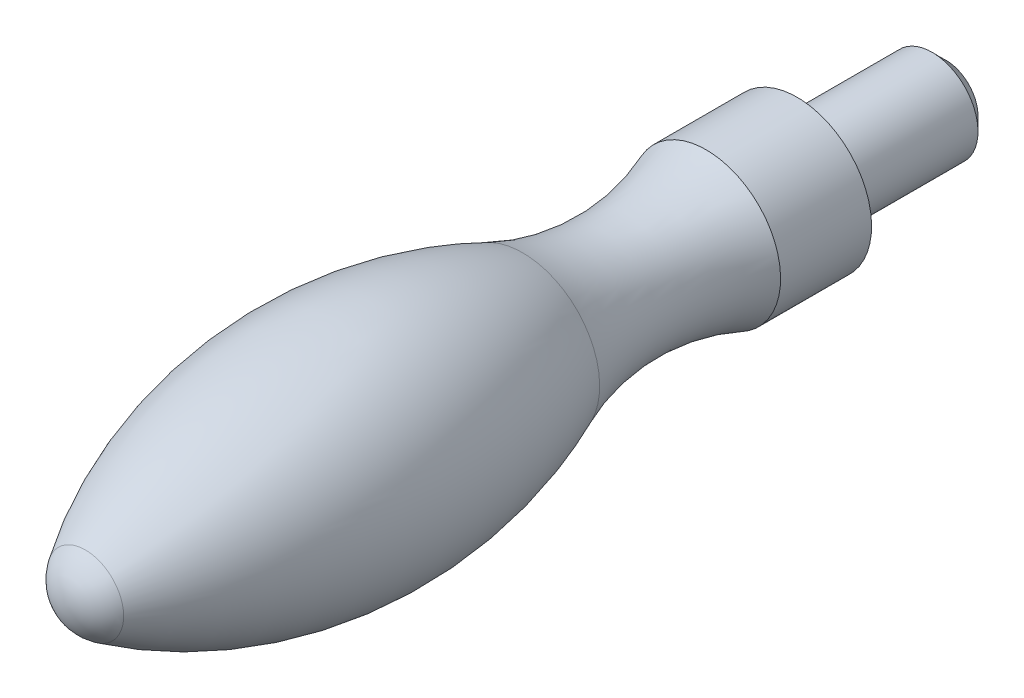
ISO-10303-21;
HEADER;
FILE_DESCRIPTION(('STEP AP214'),'2;1');
FILE_NAME('part.step','',(''),(''),'','','');
FILE_SCHEMA(('AUTOMOTIVE_DESIGN { 1 0 10303 214 1 1 1 1 }'));
ENDSEC;
DATA;
#1=APPLICATION_CONTEXT('core data for automotive mechanical design processes');
#2=APPLICATION_PROTOCOL_DEFINITION('international standard','automotive_design',2000,#1);
#3=PRODUCT_CONTEXT('',#1,'mechanical');
#4=PRODUCT('Part','Part','',(#3));
#5=PRODUCT_RELATED_PRODUCT_CATEGORY('part','',(#4));
#6=PRODUCT_DEFINITION_FORMATION('','',#4);
#7=PRODUCT_DEFINITION_CONTEXT('part definition',#1,'design');
#8=PRODUCT_DEFINITION('design','',#6,#7);
#9=PRODUCT_DEFINITION_SHAPE('','',#8);
#10=(LENGTH_UNIT() NAMED_UNIT(*) SI_UNIT(.MILLI.,.METRE.));
#11=(NAMED_UNIT(*) PLANE_ANGLE_UNIT() SI_UNIT($,.RADIAN.));
#12=(NAMED_UNIT(*) SI_UNIT($,.STERADIAN.) SOLID_ANGLE_UNIT());
#13=UNCERTAINTY_MEASURE_WITH_UNIT(LENGTH_MEASURE(1.E-05),#10,'distance_accuracy_value','');
#14=(GEOMETRIC_REPRESENTATION_CONTEXT(3) GLOBAL_UNCERTAINTY_ASSIGNED_CONTEXT((#13)) GLOBAL_UNIT_ASSIGNED_CONTEXT((#10,
#11,#12)) REPRESENTATION_CONTEXT('',''));
#15=CARTESIAN_POINT('',(0.,0.,0.));
#16=DIRECTION('',(0.,0.,1.));
#17=DIRECTION('',(1.,0.,0.));
#18=AXIS2_PLACEMENT_3D('',#15,#16,#17);
#19=CARTESIAN_POINT('',(-1.02446461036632E-06,0.,59.999939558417));
#20=DIRECTION('',(0.,0.,1.));
#21=DIRECTION('',(1.,0.,0.));
#22=AXIS2_PLACEMENT_3D('',#19,#20,#21);
#23=SPHERICAL_SURFACE('',#22,3.99999884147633);
#24=CARTESIAN_POINT('',(0.,0.,62.197192));
#25=DIRECTION('',(0.,0.,1.));
#26=DIRECTION('',(0.,-1.,0.));
#27=AXIS2_PLACEMENT_3D('',#24,#25,#26);
#28=CIRCLE('',#27,3.342464);
#29=CARTESIAN_POINT('',(0.,-3.342464,62.197192));
#30=VERTEX_POINT('',#29);
#31=EDGE_CURVE('E133',#30,#30,#28,.T.);
#32=ORIENTED_EDGE('',*,*,#31,.T.);
#33=EDGE_LOOP('',(#32));
#34=FACE_BOUND('',#33,.T.);
#35=ADVANCED_FACE('F14',(#34),#23,.T.);
#36=CARTESIAN_POINT('',(0.,0.,39.95));
#37=DIRECTION('',(0.,0.,1.));
#38=DIRECTION('',(0.,-1.,0.));
#39=AXIS2_PLACEMENT_3D('',#36,#37,#38);
#40=DEGENERATE_TOROIDAL_SURFACE('',#39,30.5,40.4999990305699,.F.);
#41=CARTESIAN_POINT('',(0.,0.,23.9808672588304));
#42=DIRECTION('',(0.,0.,1.));
#43=DIRECTION('',(0.,-1.,0.));
#44=AXIS2_PLACEMENT_3D('',#41,#42,#43);
#45=CIRCLE('',#44,6.71876839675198);
#46=CARTESIAN_POINT('',(0.,-6.71876839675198,23.9808672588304));
#47=VERTEX_POINT('',#46);
#48=EDGE_CURVE('E130',#47,#47,#45,.T.);
#49=ORIENTED_EDGE('',*,*,#48,.T.);
#50=EDGE_LOOP('',(#49));
#51=FACE_BOUND('',#50,.T.);
#52=ORIENTED_EDGE('',*,*,#31,.F.);
#53=EDGE_LOOP('',(#52));
#54=FACE_BOUND('',#53,.T.);
#55=ADVANCED_FACE('F151',(#51,#54),#40,.F.);
#56=CARTESIAN_POINT('',(0.,0.,15.7005784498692));
#57=DIRECTION('',(0.,0.,1.));
#58=DIRECTION('',(0.,-1.,0.));
#59=AXIS2_PLACEMENT_3D('',#56,#57,#58);
#60=TOROIDAL_SURFACE('',#59,26.017389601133,20.9999991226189);
#61=CARTESIAN_POINT('',(0.,0.,7.95));
#62=DIRECTION('',(0.,0.,1.));
#63=DIRECTION('',(0.,-1.,0.));
#64=AXIS2_PLACEMENT_3D('',#61,#62,#63);
#65=CIRCLE('',#64,6.5);
#66=CARTESIAN_POINT('',(0.,-6.5,7.95));
#67=VERTEX_POINT('',#66);
#68=EDGE_CURVE('E127',#67,#67,#65,.T.);
#69=ORIENTED_EDGE('',*,*,#68,.T.);
#70=EDGE_LOOP('',(#69));
#71=FACE_BOUND('',#70,.T.);
#72=ORIENTED_EDGE('',*,*,#48,.F.);
#73=EDGE_LOOP('',(#72));
#74=FACE_BOUND('',#73,.T.);
#75=ADVANCED_FACE('F156',(#71,#74),#60,.F.);
#76=CARTESIAN_POINT('',(0.,0.,67.0499368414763));
#77=DIRECTION('',(0.,0.,1.));
#78=DIRECTION('',(0.,-1.,0.));
#79=AXIS2_PLACEMENT_3D('',#76,#77,#78);
#80=CYLINDRICAL_SURFACE('',#79,6.5);
#81=CARTESIAN_POINT('',(0.,0.,0.));
#82=DIRECTION('',(0.,0.,1.));
#83=DIRECTION('',(0.,-1.,0.));
#84=AXIS2_PLACEMENT_3D('',#81,#82,#83);
#85=CIRCLE('',#84,6.5);
#86=CARTESIAN_POINT('',(0.,-6.5,0.));
#87=VERTEX_POINT('',#86);
#88=EDGE_CURVE('E124',#87,#87,#85,.T.);
#89=ORIENTED_EDGE('',*,*,#88,.T.);
#90=EDGE_LOOP('',(#89));
#91=FACE_BOUND('',#90,.T.);
#92=ORIENTED_EDGE('',*,*,#68,.F.);
#93=EDGE_LOOP('',(#92));
#94=FACE_BOUND('',#93,.T.);
#95=ADVANCED_FACE('F162',(#91,#94),#80,.T.);
#96=CARTESIAN_POINT('',(6.5,0.,0.));
#97=DIRECTION('',(0.,0.,-1.));
#98=DIRECTION('',(0.,1.,0.));
#99=AXIS2_PLACEMENT_3D('',#96,#97,#98);
#100=PLANE('',#99);
#101=CARTESIAN_POINT('',(0.,0.,0.));
#102=DIRECTION('',(0.,0.,1.));
#103=DIRECTION('',(0.,-1.,0.));
#104=AXIS2_PLACEMENT_3D('',#101,#102,#103);
#105=CIRCLE('',#104,4.);
#106=CARTESIAN_POINT('',(0.,-4.,0.));
#107=VERTEX_POINT('',#106);
#108=EDGE_CURVE('E116',#107,#107,#105,.T.);
#109=ORIENTED_EDGE('',*,*,#108,.T.);
#110=EDGE_LOOP('',(#109));
#111=FACE_BOUND('',#110,.T.);
#112=ORIENTED_EDGE('',*,*,#88,.F.);
#113=EDGE_LOOP('',(#112));
#114=FACE_BOUND('',#113,.T.);
#115=ADVANCED_FACE('F166',(#111,#114),#100,.T.);
#116=CARTESIAN_POINT('',(0.,0.,67.0499368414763));
#117=DIRECTION('',(0.,0.,1.));
#118=DIRECTION('',(0.,-1.,0.));
#119=AXIS2_PLACEMENT_3D('',#116,#117,#118);
#120=CYLINDRICAL_SURFACE('',#119,4.);
#121=CARTESIAN_POINT('',(0.,0.,-11.8));
#122=DIRECTION('',(0.,0.,-1.));
#123=DIRECTION('',(-1.,0.,0.));
#124=AXIS2_PLACEMENT_3D('',#121,#122,#123);
#125=CIRCLE('',#124,4.);
#126=CARTESIAN_POINT('',(-4.,0.,-11.8));
#127=VERTEX_POINT('',#126);
#128=EDGE_CURVE('E22',#127,#127,#125,.F.);
#129=ORIENTED_EDGE('',*,*,#128,.T.);
#130=EDGE_LOOP('',(#129));
#131=FACE_BOUND('',#130,.T.);
#132=ORIENTED_EDGE('',*,*,#108,.F.);
#133=EDGE_LOOP('',(#132));
#134=FACE_BOUND('',#133,.T.);
#135=ADVANCED_FACE('F138',(#131,#134),#120,.T.);
#136=CARTESIAN_POINT('',(4.,0.,-13.));
#137=DIRECTION('',(0.,0.,-1.));
#138=DIRECTION('',(0.,1.,0.));
#139=AXIS2_PLACEMENT_3D('',#136,#137,#138);
#140=PLANE('',#139);
#141=CARTESIAN_POINT('',(0.,0.,-13.));
#142=DIRECTION('',(0.,0.,-1.));
#143=DIRECTION('',(-1.,0.,0.));
#144=AXIS2_PLACEMENT_3D('',#141,#142,#143);
#145=CIRCLE('',#144,2.8);
#146=CARTESIAN_POINT('',(-2.8,0.,-13.));
#147=VERTEX_POINT('',#146);
#148=EDGE_CURVE('E9',#147,#147,#145,.T.);
#149=ORIENTED_EDGE('',*,*,#148,.T.);
#150=EDGE_LOOP('',(#149));
#151=FACE_BOUND('',#150,.T.);
#152=DIRECTION('',(0.866025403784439,0.5,0.));
#153=VECTOR('',#152,1.);
#154=CARTESIAN_POINT('',(-2.,1.15470053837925,-13.));
#155=LINE('',#154,#153);
#156=CARTESIAN_POINT('',(-2.,1.15470053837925,-13.));
#157=VERTEX_POINT('',#156);
#158=CARTESIAN_POINT('',(0.,2.30940107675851,-13.));
#159=VERTEX_POINT('',#158);
#160=EDGE_CURVE('E29',#157,#159,#155,.T.);
#161=ORIENTED_EDGE('',*,*,#160,.F.);
#162=DIRECTION('',(0.,1.,0.));
#163=VECTOR('',#162,1.);
#164=CARTESIAN_POINT('',(-2.,-1.15470053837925,-13.));
#165=LINE('',#164,#163);
#166=CARTESIAN_POINT('',(-2.,-1.15470053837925,-13.));
#167=VERTEX_POINT('',#166);
#168=EDGE_CURVE('E112',#167,#157,#165,.T.);
#169=ORIENTED_EDGE('',*,*,#168,.F.);
#170=DIRECTION('',(-0.866025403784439,0.5,0.));
#171=VECTOR('',#170,1.);
#172=CARTESIAN_POINT('',(0.,-2.30940107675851,-13.));
#173=LINE('',#172,#171);
#174=CARTESIAN_POINT('',(0.,-2.30940107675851,-13.));
#175=VERTEX_POINT('',#174);
#176=EDGE_CURVE('E110',#175,#167,#173,.T.);
#177=ORIENTED_EDGE('',*,*,#176,.F.);
#178=DIRECTION('',(-0.866025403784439,-0.5,0.));
#179=VECTOR('',#178,1.);
#180=CARTESIAN_POINT('',(2.,-1.15470053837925,-13.));
#181=LINE('',#180,#179);
#182=CARTESIAN_POINT('',(2.,-1.15470053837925,-13.));
#183=VERTEX_POINT('',#182);
#184=EDGE_CURVE('E77',#183,#175,#181,.T.);
#185=ORIENTED_EDGE('',*,*,#184,.F.);
#186=DIRECTION('',(0.,-1.,0.));
#187=VECTOR('',#186,1.);
#188=CARTESIAN_POINT('',(2.,1.15470053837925,-13.));
#189=LINE('',#188,#187);
#190=CARTESIAN_POINT('',(2.,1.15470053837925,-13.));
#191=VERTEX_POINT('',#190);
#192=EDGE_CURVE('E106',#191,#183,#189,.T.);
#193=ORIENTED_EDGE('',*,*,#192,.F.);
#194=DIRECTION('',(0.866025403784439,-0.5,0.));
#195=VECTOR('',#194,1.);
#196=CARTESIAN_POINT('',(0.,2.30940107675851,-13.));
#197=LINE('',#196,#195);
#198=EDGE_CURVE('E103',#159,#191,#197,.T.);
#199=ORIENTED_EDGE('',*,*,#198,.F.);
#200=EDGE_LOOP('',(#161,#169,#177,#185,#193,#199));
#201=FACE_BOUND('',#200,.T.);
#202=ADVANCED_FACE('F173',(#151,#201),#140,.T.);
#203=CARTESIAN_POINT('',(-2.,1.15470053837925,-9.));
#204=DIRECTION('',(-0.5,0.866025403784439,0.));
#205=DIRECTION('',(-0.866025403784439,-0.5,0.));
#206=AXIS2_PLACEMENT_3D('',#203,#204,#205);
#207=PLANE('',#206);
#208=ORIENTED_EDGE('',*,*,#160,.T.);
#209=DIRECTION('',(0.,0.,-1.));
#210=VECTOR('',#209,1.);
#211=CARTESIAN_POINT('',(0.,2.30940107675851,-9.));
#212=LINE('',#211,#210);
#213=CARTESIAN_POINT('',(0.,2.30940107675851,-9.));
#214=VERTEX_POINT('',#213);
#215=EDGE_CURVE('E59',#214,#159,#212,.T.);
#216=ORIENTED_EDGE('',*,*,#215,.F.);
#217=DIRECTION('',(0.866025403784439,0.5,0.));
#218=VECTOR('',#217,1.);
#219=CARTESIAN_POINT('',(-2.,1.15470053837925,-9.));
#220=LINE('',#219,#218);
#221=CARTESIAN_POINT('',(-2.,1.15470053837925,-9.));
#222=VERTEX_POINT('',#221);
#223=EDGE_CURVE('E114',#222,#214,#220,.T.);
#224=ORIENTED_EDGE('',*,*,#223,.F.);
#225=DIRECTION('',(0.,0.,-1.));
#226=VECTOR('',#225,1.);
#227=CARTESIAN_POINT('',(-2.,1.15470053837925,-9.));
#228=LINE('',#227,#226);
#229=EDGE_CURVE('E37',#222,#157,#228,.T.);
#230=ORIENTED_EDGE('',*,*,#229,.T.);
#231=EDGE_LOOP('',(#208,#216,#224,#230));
#232=FACE_BOUND('',#231,.T.);
#233=ADVANCED_FACE('F176',(#232),#207,.F.);
#234=CARTESIAN_POINT('',(-2.,-1.15470053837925,-9.));
#235=DIRECTION('',(-1.,0.,0.));
#236=DIRECTION('',(0.,-1.,0.));
#237=AXIS2_PLACEMENT_3D('',#234,#235,#236);
#238=PLANE('',#237);
#239=ORIENTED_EDGE('',*,*,#168,.T.);
#240=ORIENTED_EDGE('',*,*,#229,.F.);
#241=DIRECTION('',(0.,1.,0.));
#242=VECTOR('',#241,1.);
#243=CARTESIAN_POINT('',(-2.,-1.15470053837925,-9.));
#244=LINE('',#243,#242);
#245=CARTESIAN_POINT('',(-2.,-1.15470053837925,-9.));
#246=VERTEX_POINT('',#245);
#247=EDGE_CURVE('E89',#246,#222,#244,.T.);
#248=ORIENTED_EDGE('',*,*,#247,.F.);
#249=DIRECTION('',(0.,0.,-1.));
#250=VECTOR('',#249,1.);
#251=CARTESIAN_POINT('',(-2.,-1.15470053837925,-9.));
#252=LINE('',#251,#250);
#253=EDGE_CURVE('E81',#246,#167,#252,.T.);
#254=ORIENTED_EDGE('',*,*,#253,.T.);
#255=EDGE_LOOP('',(#239,#240,#248,#254));
#256=FACE_BOUND('',#255,.T.);
#257=ADVANCED_FACE('F180',(#256),#238,.F.);
#258=CARTESIAN_POINT('',(0.,-2.30940107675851,-9.));
#259=DIRECTION('',(-0.5,-0.866025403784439,0.));
#260=DIRECTION('',(0.866025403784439,-0.5,0.));
#261=AXIS2_PLACEMENT_3D('',#258,#259,#260);
#262=PLANE('',#261);
#263=ORIENTED_EDGE('',*,*,#176,.T.);
#264=ORIENTED_EDGE('',*,*,#253,.F.);
#265=DIRECTION('',(-0.866025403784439,0.5,0.));
#266=VECTOR('',#265,1.);
#267=CARTESIAN_POINT('',(0.,-2.30940107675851,-9.));
#268=LINE('',#267,#266);
#269=CARTESIAN_POINT('',(0.,-2.30940107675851,-9.));
#270=VERTEX_POINT('',#269);
#271=EDGE_CURVE('E85',#270,#246,#268,.T.);
#272=ORIENTED_EDGE('',*,*,#271,.F.);
#273=DIRECTION('',(0.,0.,-1.));
#274=VECTOR('',#273,1.);
#275=CARTESIAN_POINT('',(0.,-2.30940107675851,-9.));
#276=LINE('',#275,#274);
#277=EDGE_CURVE('E70',#270,#175,#276,.T.);
#278=ORIENTED_EDGE('',*,*,#277,.T.);
#279=EDGE_LOOP('',(#263,#264,#272,#278));
#280=FACE_BOUND('',#279,.T.);
#281=ADVANCED_FACE('F86',(#280),#262,.F.);
#282=CARTESIAN_POINT('',(2.,-1.15470053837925,-9.));
#283=DIRECTION('',(0.5,-0.866025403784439,0.));
#284=DIRECTION('',(0.866025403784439,0.5,0.));
#285=AXIS2_PLACEMENT_3D('',#282,#283,#284);
#286=PLANE('',#285);
#287=ORIENTED_EDGE('',*,*,#184,.T.);
#288=ORIENTED_EDGE('',*,*,#277,.F.);
#289=DIRECTION('',(-0.866025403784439,-0.5,0.));
#290=VECTOR('',#289,1.);
#291=CARTESIAN_POINT('',(2.,-1.15470053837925,-9.));
#292=LINE('',#291,#290);
#293=CARTESIAN_POINT('',(2.,-1.15470053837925,-9.));
#294=VERTEX_POINT('',#293);
#295=EDGE_CURVE('E74',#294,#270,#292,.T.);
#296=ORIENTED_EDGE('',*,*,#295,.F.);
#297=DIRECTION('',(0.,0.,-1.));
#298=VECTOR('',#297,1.);
#299=CARTESIAN_POINT('',(2.,-1.15470053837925,-9.));
#300=LINE('',#299,#298);
#301=EDGE_CURVE('E82',#294,#183,#300,.T.);
#302=ORIENTED_EDGE('',*,*,#301,.T.);
#303=EDGE_LOOP('',(#287,#288,#296,#302));
#304=FACE_BOUND('',#303,.T.);
#305=ADVANCED_FACE('F72',(#304),#286,.F.);
#306=CARTESIAN_POINT('',(2.,1.15470053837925,-9.));
#307=DIRECTION('',(1.,0.,0.));
#308=DIRECTION('',(0.,0.,-1.));
#309=AXIS2_PLACEMENT_3D('',#306,#307,#308);
#310=PLANE('',#309);
#311=ORIENTED_EDGE('',*,*,#192,.T.);
#312=ORIENTED_EDGE('',*,*,#301,.F.);
#313=DIRECTION('',(0.,-1.,0.));
#314=VECTOR('',#313,1.);
#315=CARTESIAN_POINT('',(2.,1.15470053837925,-9.));
#316=LINE('',#315,#314);
#317=CARTESIAN_POINT('',(2.,1.15470053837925,-9.));
#318=VERTEX_POINT('',#317);
#319=EDGE_CURVE('E95',#318,#294,#316,.T.);
#320=ORIENTED_EDGE('',*,*,#319,.F.);
#321=DIRECTION('',(0.,0.,-1.));
#322=VECTOR('',#321,1.);
#323=CARTESIAN_POINT('',(2.,1.15470053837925,-9.));
#324=LINE('',#323,#322);
#325=EDGE_CURVE('E119',#318,#191,#324,.T.);
#326=ORIENTED_EDGE('',*,*,#325,.T.);
#327=EDGE_LOOP('',(#311,#312,#320,#326));
#328=FACE_BOUND('',#327,.T.);
#329=ADVANCED_FACE('F183',(#328),#310,.F.);
#330=CARTESIAN_POINT('',(0.,2.30940107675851,-9.));
#331=DIRECTION('',(0.5,0.866025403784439,0.));
#332=DIRECTION('',(-0.866025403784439,0.5,0.));
#333=AXIS2_PLACEMENT_3D('',#330,#331,#332);
#334=PLANE('',#333);
#335=ORIENTED_EDGE('',*,*,#198,.T.);
#336=ORIENTED_EDGE('',*,*,#325,.F.);
#337=DIRECTION('',(0.866025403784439,-0.5,0.));
#338=VECTOR('',#337,1.);
#339=CARTESIAN_POINT('',(0.,2.30940107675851,-9.));
#340=LINE('',#339,#338);
#341=EDGE_CURVE('E97',#214,#318,#340,.T.);
#342=ORIENTED_EDGE('',*,*,#341,.F.);
#343=ORIENTED_EDGE('',*,*,#215,.T.);
#344=EDGE_LOOP('',(#335,#336,#342,#343));
#345=FACE_BOUND('',#344,.T.);
#346=ADVANCED_FACE('F147',(#345),#334,.F.);
#347=CARTESIAN_POINT('',(0.,2.30940107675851,-9.));
#348=DIRECTION('',(0.,0.,-1.));
#349=DIRECTION('',(-1.,0.,0.));
#350=AXIS2_PLACEMENT_3D('',#347,#348,#349);
#351=PLANE('',#350);
#352=ORIENTED_EDGE('',*,*,#223,.T.);
#353=ORIENTED_EDGE('',*,*,#341,.T.);
#354=ORIENTED_EDGE('',*,*,#319,.T.);
#355=ORIENTED_EDGE('',*,*,#295,.T.);
#356=ORIENTED_EDGE('',*,*,#271,.T.);
#357=ORIENTED_EDGE('',*,*,#247,.T.);
#358=EDGE_LOOP('',(#352,#353,#354,#355,#356,#357));
#359=FACE_BOUND('',#358,.T.);
#360=ADVANCED_FACE('F92',(#359),#351,.T.);
#361=CARTESIAN_POINT('',(0.,0.,-11.8));
#362=DIRECTION('',(0.,0.,1.));
#363=DIRECTION('',(1.,0.,0.));
#364=AXIS2_PLACEMENT_3D('',#361,#362,#363);
#365=CONICAL_SURFACE('',#364,4.,0.78539816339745);
#366=ORIENTED_EDGE('',*,*,#148,.F.);
#367=EDGE_LOOP('',(#366));
#368=FACE_BOUND('',#367,.T.);
#369=ORIENTED_EDGE('',*,*,#128,.F.);
#370=EDGE_LOOP('',(#369));
#371=FACE_BOUND('',#370,.T.);
#372=ADVANCED_FACE('F16',(#368,#371),#365,.T.);
#373=CLOSED_SHELL('',(#35,#55,#75,#95,#115,#135,#202,#233,#257,#281,#305,#329,#346,#360,#372));
#374=MANIFOLD_SOLID_BREP('B1',#373);
#375=ADVANCED_BREP_SHAPE_REPRESENTATION('',(#18,#374),#14);
#376=SHAPE_DEFINITION_REPRESENTATION(#9,#375);
ENDSEC;
END-ISO-10303-21;
